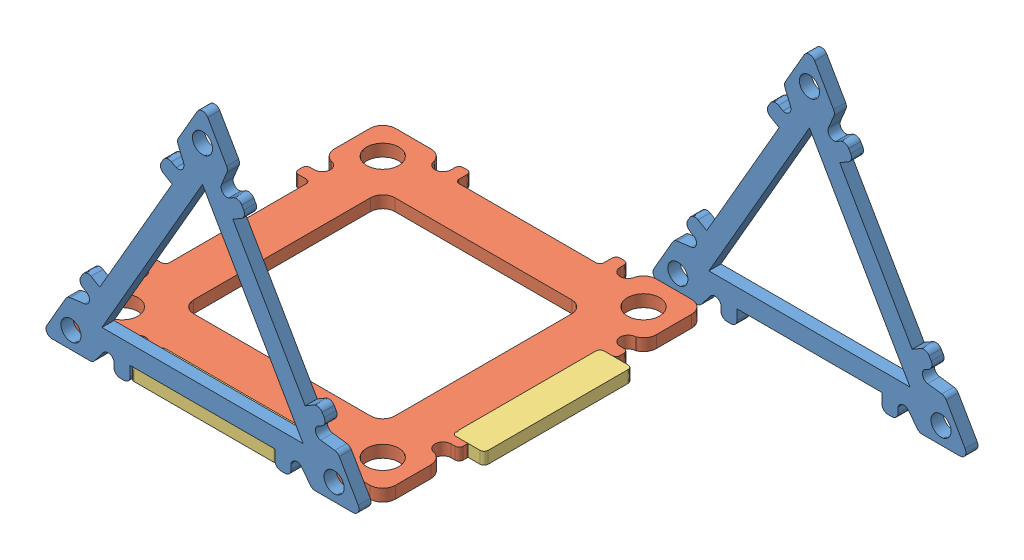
SolidWorks assembly Assem1.SLDASM, configuration Default (file format 8000). Lengths in mm.
Overall size (132.57 76.58 99.4).
5 component instances, 3 part files, 8 mates.
Components (placement in the parent):
- Part2-1: Part2.SLDPRT [Default] at (26.9973 49.6916 61.6225) size (77.8 67.78 3)
- Part1-1: Part1.SLDPRT [Default] at (27.7947 27.5976 20.6225) x (1 0 0) z (0 1 0) size (80 80 3)
- Part3-1: Part3.SLDPRT [Default] at (27.3973 27.5976 60.6225) x (0 0 -1) z (0 1 0) size (8 36.8 3)
- Part3-2: Part3.SLDPRT [Default] at (67.7947 30.5976 21.0199) x (1 0 0) z (0 -1 0) size (8 36.8 3)
- Part2-2: Part2.SLDPRT [Default] at (81.4603 40.894 -34.7813) size (77.8 67.78 3)
Mates (geometry in assembly coordinates):
- Coincident1: coincident anti-aligned: plane of Part2-1 through (8.9973 49.6916 64.6225) normal (1 0 0); plane of Part3-1 through (8.9973 30.5976 57.6225) normal (-1 0 0)
- Coincident2: coincident anti-aligned: plane of Part2-1 through (26.9973 30.5976 64.6225) normal (0 -1 0); plane of Part3-1 through (44.7973 30.5976 57.6225) normal (0 1 0)
- Coincident3: coincident aligned: plane of Part2-1 through (26.9973 49.6916 64.6225) normal (0 0 1); plane of Part3-1 through (9.9973 30.5976 64.6225) normal (0 0 1)
- Coincident4: coincident aligned: plane of Part1-1 through (27.7947 27.5976 20.6225) normal (0 -1 0); plane of Part3-1 through (44.7973 27.5976 57.6225) normal (0 -1 0)
- Coincident5: coincident anti-aligned: plane of Part1-1 through (27.7947 30.5976 56.6225) normal (0 0 1); plane of Part3-1 through (9.9973 30.5976 56.6225) normal (0 0 -1)
- Coincident6: coincident anti-aligned: plane of Part1-1 through (45.7973 30.5976 20.6225) normal (-1 0 0); plane of Part3-1 through (45.7973 30.5976 57.6225) normal (1 0 0)
- Coincident7: coincident anti-aligned: line of Part3-2 through (63.7947 30.5976 38.4199) axis (0 0 -1); line of Part1-1 through (63.7947 30.5976 3.6199) axis (0 0 1)
- Coincident10: coincident: line of Part1-1 through (64.7947 30.5976 2.6199) axis (1 0 0); point of Part3-2
